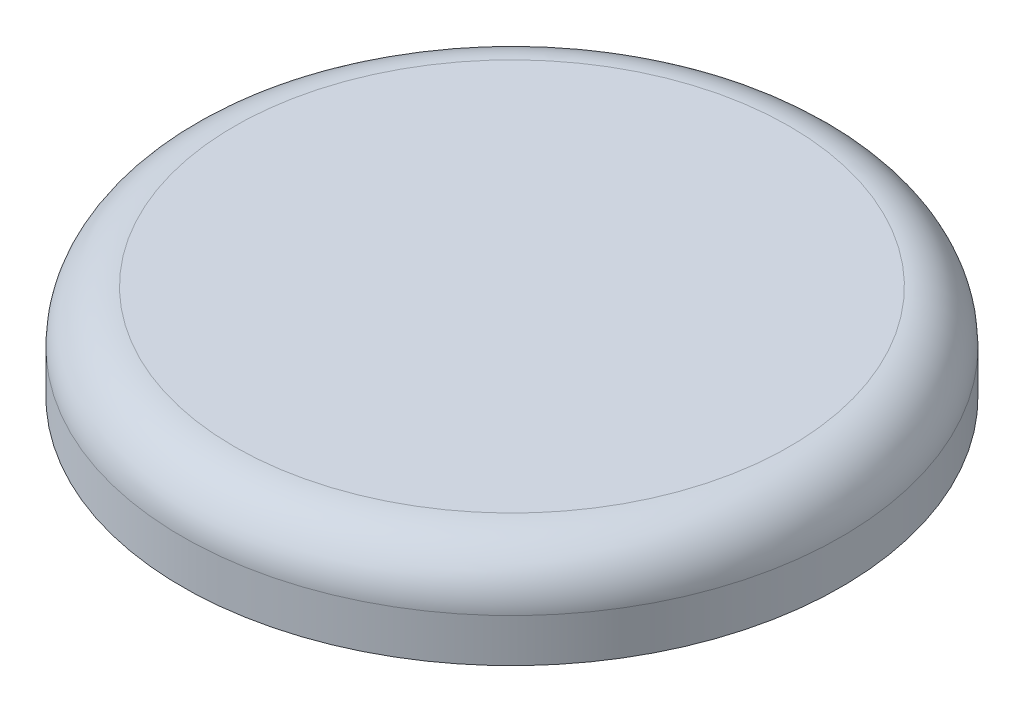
ISO-10303-21;
HEADER;
FILE_DESCRIPTION(('STEP AP214'),'2;1');
FILE_NAME('part.step','',(''),(''),'','','');
FILE_SCHEMA(('AUTOMOTIVE_DESIGN { 1 0 10303 214 1 1 1 1 }'));
ENDSEC;
DATA;
#1=APPLICATION_CONTEXT('core data for automotive mechanical design processes');
#2=APPLICATION_PROTOCOL_DEFINITION('international standard','automotive_design',2000,#1);
#3=PRODUCT_CONTEXT('',#1,'mechanical');
#4=PRODUCT('Part','Part','',(#3));
#5=PRODUCT_RELATED_PRODUCT_CATEGORY('part','',(#4));
#6=PRODUCT_DEFINITION_FORMATION('','',#4);
#7=PRODUCT_DEFINITION_CONTEXT('part definition',#1,'design');
#8=PRODUCT_DEFINITION('design','',#6,#7);
#9=PRODUCT_DEFINITION_SHAPE('','',#8);
#10=(LENGTH_UNIT() NAMED_UNIT(*) SI_UNIT(.MILLI.,.METRE.));
#11=(NAMED_UNIT(*) PLANE_ANGLE_UNIT() SI_UNIT($,.RADIAN.));
#12=(NAMED_UNIT(*) SI_UNIT($,.STERADIAN.) SOLID_ANGLE_UNIT());
#13=UNCERTAINTY_MEASURE_WITH_UNIT(LENGTH_MEASURE(1.E-05),#10,'distance_accuracy_value','');
#14=(GEOMETRIC_REPRESENTATION_CONTEXT(3) GLOBAL_UNCERTAINTY_ASSIGNED_CONTEXT((#13)) GLOBAL_UNIT_ASSIGNED_CONTEXT((#10,
#11,#12)) REPRESENTATION_CONTEXT('',''));
#15=CARTESIAN_POINT('',(0.,0.,0.));
#16=DIRECTION('',(0.,0.,1.));
#17=DIRECTION('',(1.,0.,0.));
#18=AXIS2_PLACEMENT_3D('',#15,#16,#17);
#19=CARTESIAN_POINT('',(0.,-2.036,0.));
#20=DIRECTION('',(0.,1.,0.));
#21=DIRECTION('',(0.,0.,1.));
#22=AXIS2_PLACEMENT_3D('',#19,#20,#21);
#23=CONICAL_SURFACE('',#22,7.7877,0.0436332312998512);
#24=CARTESIAN_POINT('',(0.,-2.036,0.));
#25=DIRECTION('',(0.,-1.,0.));
#26=DIRECTION('',(0.,0.,-1.));
#27=AXIS2_PLACEMENT_3D('',#24,#25,#26);
#28=CIRCLE('',#27,7.7877);
#29=CARTESIAN_POINT('',(0.,-2.036,-7.7877));
#30=VERTEX_POINT('',#29);
#31=EDGE_CURVE('E69',#30,#30,#28,.T.);
#32=ORIENTED_EDGE('',*,*,#31,.T.);
#33=EDGE_LOOP('',(#32));
#34=FACE_BOUND('',#33,.T.);
#35=CARTESIAN_POINT('',(0.,-6.52097576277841,0.));
#36=DIRECTION('',(0.,-1.,0.));
#37=DIRECTION('',(0.,0.,-1.));
#38=AXIS2_PLACEMENT_3D('',#35,#36,#37);
#39=CIRCLE('',#38,7.5918817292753);
#40=CARTESIAN_POINT('',(0.,-6.52097576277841,-7.5918817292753));
#41=VERTEX_POINT('',#40);
#42=EDGE_CURVE('E44',#41,#41,#39,.T.);
#43=ORIENTED_EDGE('',*,*,#42,.F.);
#44=EDGE_LOOP('',(#43));
#45=FACE_BOUND('',#44,.T.);
#46=ADVANCED_FACE('F37',(#34,#45),#23,.T.);
#47=CARTESIAN_POINT('',(0.,0.,0.));
#48=DIRECTION('',(0.,-1.,0.));
#49=DIRECTION('',(0.,0.,-1.));
#50=AXIS2_PLACEMENT_3D('',#47,#48,#49);
#51=PLANE('',#50);
#52=CARTESIAN_POINT('',(0.,0.,0.));
#53=DIRECTION('',(0.,-1.,0.));
#54=DIRECTION('',(0.,0.,-1.));
#55=AXIS2_PLACEMENT_3D('',#52,#53,#54);
#56=CIRCLE('',#55,16.288);
#57=CARTESIAN_POINT('',(0.,0.,-16.288));
#58=VERTEX_POINT('',#57);
#59=EDGE_CURVE('E57',#58,#58,#56,.F.);
#60=ORIENTED_EDGE('',*,*,#59,.T.);
#61=EDGE_LOOP('',(#60));
#62=FACE_BOUND('',#61,.T.);
#63=ADVANCED_FACE('F105',(#62),#51,.F.);
#64=CARTESIAN_POINT('',(0.,0.,0.));
#65=DIRECTION('',(0.,-1.,0.));
#66=DIRECTION('',(0.,0.,-1.));
#67=AXIS2_PLACEMENT_3D('',#64,#65,#66);
#68=CYLINDRICAL_SURFACE('',#67,19.342);
#69=CARTESIAN_POINT('',(0.,-3.054,0.));
#70=DIRECTION('',(0.,-1.,0.));
#71=DIRECTION('',(0.,0.,-1.));
#72=AXIS2_PLACEMENT_3D('',#69,#70,#71);
#73=CIRCLE('',#72,19.342);
#74=CARTESIAN_POINT('',(0.,-3.054,-19.342));
#75=VERTEX_POINT('',#74);
#76=EDGE_CURVE('E60',#75,#75,#73,.T.);
#77=ORIENTED_EDGE('',*,*,#76,.T.);
#78=EDGE_LOOP('',(#77));
#79=FACE_BOUND('',#78,.T.);
#80=CARTESIAN_POINT('',(0.,-5.599,0.));
#81=DIRECTION('',(0.,-1.,0.));
#82=DIRECTION('',(0.,0.,-1.));
#83=AXIS2_PLACEMENT_3D('',#80,#81,#82);
#84=CIRCLE('',#83,19.342);
#85=CARTESIAN_POINT('',(0.,-5.599,-19.342));
#86=VERTEX_POINT('',#85);
#87=EDGE_CURVE('E63',#86,#86,#84,.T.);
#88=ORIENTED_EDGE('',*,*,#87,.F.);
#89=EDGE_LOOP('',(#88));
#90=FACE_BOUND('',#89,.T.);
#91=ADVANCED_FACE('F111',(#79,#90),#68,.T.);
#92=CARTESIAN_POINT('',(-19.342,-5.599,0.));
#93=DIRECTION('',(0.,1.,0.));
#94=DIRECTION('',(0.,0.,1.));
#95=AXIS2_PLACEMENT_3D('',#92,#93,#94);
#96=PLANE('',#95);
#97=CARTESIAN_POINT('',(0.,-5.599,0.));
#98=DIRECTION('',(0.,-1.,0.));
#99=DIRECTION('',(0.,0.,-1.));
#100=AXIS2_PLACEMENT_3D('',#97,#98,#99);
#101=CIRCLE('',#100,16.797);
#102=CARTESIAN_POINT('',(0.,-5.599,-16.797));
#103=VERTEX_POINT('',#102);
#104=EDGE_CURVE('E66',#103,#103,#101,.T.);
#105=ORIENTED_EDGE('',*,*,#104,.F.);
#106=EDGE_LOOP('',(#105));
#107=FACE_BOUND('',#106,.T.);
#108=ORIENTED_EDGE('',*,*,#87,.T.);
#109=EDGE_LOOP('',(#108));
#110=FACE_BOUND('',#109,.T.);
#111=ADVANCED_FACE('F127',(#107,#110),#96,.F.);
#112=CARTESIAN_POINT('',(0.,-5.599,0.));
#113=DIRECTION('',(0.,-1.,0.));
#114=DIRECTION('',(0.,0.,-1.));
#115=AXIS2_PLACEMENT_3D('',#112,#113,#114);
#116=CONICAL_SURFACE('',#115,16.797,0.0872664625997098);
#117=CARTESIAN_POINT('',(0.,-2.96527545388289,0.));
#118=DIRECTION('',(0.,-1.,0.));
#119=DIRECTION('',(0.,0.,-1.));
#120=AXIS2_PLACEMENT_3D('',#117,#118,#119);
#121=CIRCLE('',#120,16.5665789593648);
#122=CARTESIAN_POINT('',(0.,-2.96527545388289,-16.5665789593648));
#123=VERTEX_POINT('',#122);
#124=EDGE_CURVE('E48',#123,#123,#121,.F.);
#125=ORIENTED_EDGE('',*,*,#124,.T.);
#126=EDGE_LOOP('',(#125));
#127=FACE_BOUND('',#126,.T.);
#128=ORIENTED_EDGE('',*,*,#104,.T.);
#129=EDGE_LOOP('',(#128));
#130=FACE_BOUND('',#129,.T.);
#131=ADVANCED_FACE('F120',(#127,#130),#116,.F.);
#132=CARTESIAN_POINT('',(-16.4852778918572,-2.036,0.));
#133=DIRECTION('',(0.,1.,0.));
#134=DIRECTION('',(0.,0.,1.));
#135=AXIS2_PLACEMENT_3D('',#132,#133,#134);
#136=PLANE('',#135);
#137=CARTESIAN_POINT('',(0.,-2.036,0.));
#138=DIRECTION('',(0.,1.,0.));
#139=DIRECTION('',(0.,0.,1.));
#140=AXIS2_PLACEMENT_3D('',#137,#138,#139);
#141=CIRCLE('',#140,15.5524527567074);
#142=CARTESIAN_POINT('',(0.,-2.036,15.5524527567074));
#143=VERTEX_POINT('',#142);
#144=EDGE_CURVE('E52',#143,#143,#141,.F.);
#145=ORIENTED_EDGE('',*,*,#144,.T.);
#146=EDGE_LOOP('',(#145));
#147=FACE_BOUND('',#146,.T.);
#148=ORIENTED_EDGE('',*,*,#31,.F.);
#149=EDGE_LOOP('',(#148));
#150=FACE_BOUND('',#149,.T.);
#151=ADVANCED_FACE('F117',(#147,#150),#136,.F.);
#152=CARTESIAN_POINT('',(0.,-3.054,0.));
#153=DIRECTION('',(0.,-1.,0.));
#154=DIRECTION('',(0.,0.,-1.));
#155=AXIS2_PLACEMENT_3D('',#152,#153,#154);
#156=TOROIDAL_SURFACE('',#155,16.288,3.054);
#157=ORIENTED_EDGE('',*,*,#59,.F.);
#158=EDGE_LOOP('',(#157));
#159=FACE_BOUND('',#158,.T.);
#160=ORIENTED_EDGE('',*,*,#76,.F.);
#161=EDGE_LOOP('',(#160));
#162=FACE_BOUND('',#161,.T.);
#163=ADVANCED_FACE('F119',(#159,#162),#156,.T.);
#164=CARTESIAN_POINT('',(0.,-3.054,0.));
#165=DIRECTION('',(0.,1.,0.));
#166=DIRECTION('',(0.,0.,1.));
#167=AXIS2_PLACEMENT_3D('',#164,#165,#166);
#168=TOROIDAL_SURFACE('',#167,15.5524527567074,1.018);
#169=ORIENTED_EDGE('',*,*,#124,.F.);
#170=EDGE_LOOP('',(#169));
#171=FACE_BOUND('',#170,.T.);
#172=ORIENTED_EDGE('',*,*,#144,.F.);
#173=EDGE_LOOP('',(#172));
#174=FACE_BOUND('',#173,.T.);
#175=ADVANCED_FACE('F39',(#171,#174),#168,.F.);
#176=CARTESIAN_POINT('',(0.,-7.126,0.));
#177=DIRECTION('',(0.,1.,0.));
#178=DIRECTION('',(0.,0.,1.));
#179=AXIS2_PLACEMENT_3D('',#176,#177,#178);
#180=TOROIDAL_SURFACE('',#179,6.18985652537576,1.527);
#181=ORIENTED_EDGE('',*,*,#42,.T.);
#182=EDGE_LOOP('',(#181));
#183=FACE_BOUND('',#182,.T.);
#184=CARTESIAN_POINT('',(0.,-7.85091648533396,0.));
#185=DIRECTION('',(0.,1.,0.));
#186=DIRECTION('',(0.,0.,1.));
#187=AXIS2_PLACEMENT_3D('',#184,#185,#186);
#188=CIRCLE('',#187,7.53381526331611);
#189=CARTESIAN_POINT('',(0.,-7.85091648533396,7.53381526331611));
#190=VERTEX_POINT('',#189);
#191=EDGE_CURVE('E10',#190,#190,#188,.T.);
#192=ORIENTED_EDGE('',*,*,#191,.T.);
#193=EDGE_LOOP('',(#192));
#194=FACE_BOUND('',#193,.T.);
#195=ADVANCED_FACE('F179',(#183,#194),#180,.T.);
#196=CARTESIAN_POINT('',(-5.65781643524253,-2.036,0.));
#197=DIRECTION('',(0.,1.,0.));
#198=DIRECTION('',(0.,0.,1.));
#199=AXIS2_PLACEMENT_3D('',#196,#197,#198);
#200=PLANE('',#199);
#201=CARTESIAN_POINT('',(0.,-2.036,0.));
#202=DIRECTION('',(0.,-1.,0.));
#203=DIRECTION('',(0.,0.,-1.));
#204=AXIS2_PLACEMENT_3D('',#201,#202,#203);
#205=CIRCLE('',#204,5.65781643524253);
#206=CARTESIAN_POINT('',(0.,-2.036,-5.65781643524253));
#207=VERTEX_POINT('',#206);
#208=EDGE_CURVE('E78',#207,#207,#205,.T.);
#209=ORIENTED_EDGE('',*,*,#208,.T.);
#210=EDGE_LOOP('',(#209));
#211=FACE_BOUND('',#210,.T.);
#212=ADVANCED_FACE('F82',(#211),#200,.F.);
#213=CARTESIAN_POINT('',(0.,-12.0124,0.));
#214=DIRECTION('',(0.,-1.,0.));
#215=DIRECTION('',(0.,0.,-1.));
#216=AXIS2_PLACEMENT_3D('',#213,#214,#215);
#217=CONICAL_SURFACE('',#216,6.0062,0.0349065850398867);
#218=ORIENTED_EDGE('',*,*,#208,.F.);
#219=EDGE_LOOP('',(#218));
#220=FACE_BOUND('',#219,.T.);
#221=CARTESIAN_POINT('',(0.,-12.0124,0.));
#222=DIRECTION('',(0.,-1.,0.));
#223=DIRECTION('',(0.,0.,-1.));
#224=AXIS2_PLACEMENT_3D('',#221,#222,#223);
#225=CIRCLE('',#224,6.0062);
#226=CARTESIAN_POINT('',(0.,-12.0124,-6.0062));
#227=VERTEX_POINT('',#226);
#228=EDGE_CURVE('E75',#227,#227,#225,.T.);
#229=ORIENTED_EDGE('',*,*,#228,.T.);
#230=EDGE_LOOP('',(#229));
#231=FACE_BOUND('',#230,.T.);
#232=ADVANCED_FACE('F84',(#220,#231),#217,.F.);
#233=CARTESIAN_POINT('',(-7.35212096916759,-12.0124,0.));
#234=DIRECTION('',(0.,1.,0.));
#235=DIRECTION('',(0.,0.,1.));
#236=AXIS2_PLACEMENT_3D('',#233,#234,#235);
#237=PLANE('',#236);
#238=ORIENTED_EDGE('',*,*,#228,.F.);
#239=EDGE_LOOP('',(#238));
#240=FACE_BOUND('',#239,.T.);
#241=CARTESIAN_POINT('',(0.,-12.0124,0.));
#242=DIRECTION('',(0.,-1.,0.));
#243=DIRECTION('',(0.,0.,-1.));
#244=AXIS2_PLACEMENT_3D('',#241,#242,#243);
#245=CIRCLE('',#244,7.35212096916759);
#246=CARTESIAN_POINT('',(0.,-12.0124,-7.35212096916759));
#247=VERTEX_POINT('',#246);
#248=EDGE_CURVE('E72',#247,#247,#245,.T.);
#249=ORIENTED_EDGE('',*,*,#248,.T.);
#250=EDGE_LOOP('',(#249));
#251=FACE_BOUND('',#250,.T.);
#252=ADVANCED_FACE('F87',(#240,#251),#237,.F.);
#253=ORIENTED_EDGE('',*,*,#248,.F.);
#254=EDGE_LOOP('',(#253));
#255=FACE_BOUND('',#254,.T.);
#256=ORIENTED_EDGE('',*,*,#191,.F.);
#257=EDGE_LOOP('',(#256));
#258=FACE_BOUND('',#257,.T.);
#259=ADVANCED_FACE('F93',(#255,#258),#23,.T.);
#260=CLOSED_SHELL('',(#46,#63,#91,#111,#131,#151,#163,#175,#195,#212,#232,#252,#259));
#261=MANIFOLD_SOLID_BREP('B2',#260);
#262=ADVANCED_BREP_SHAPE_REPRESENTATION('',(#18,#261),#14);
#263=SHAPE_DEFINITION_REPRESENTATION(#9,#262);
ENDSEC;
END-ISO-10303-21;
